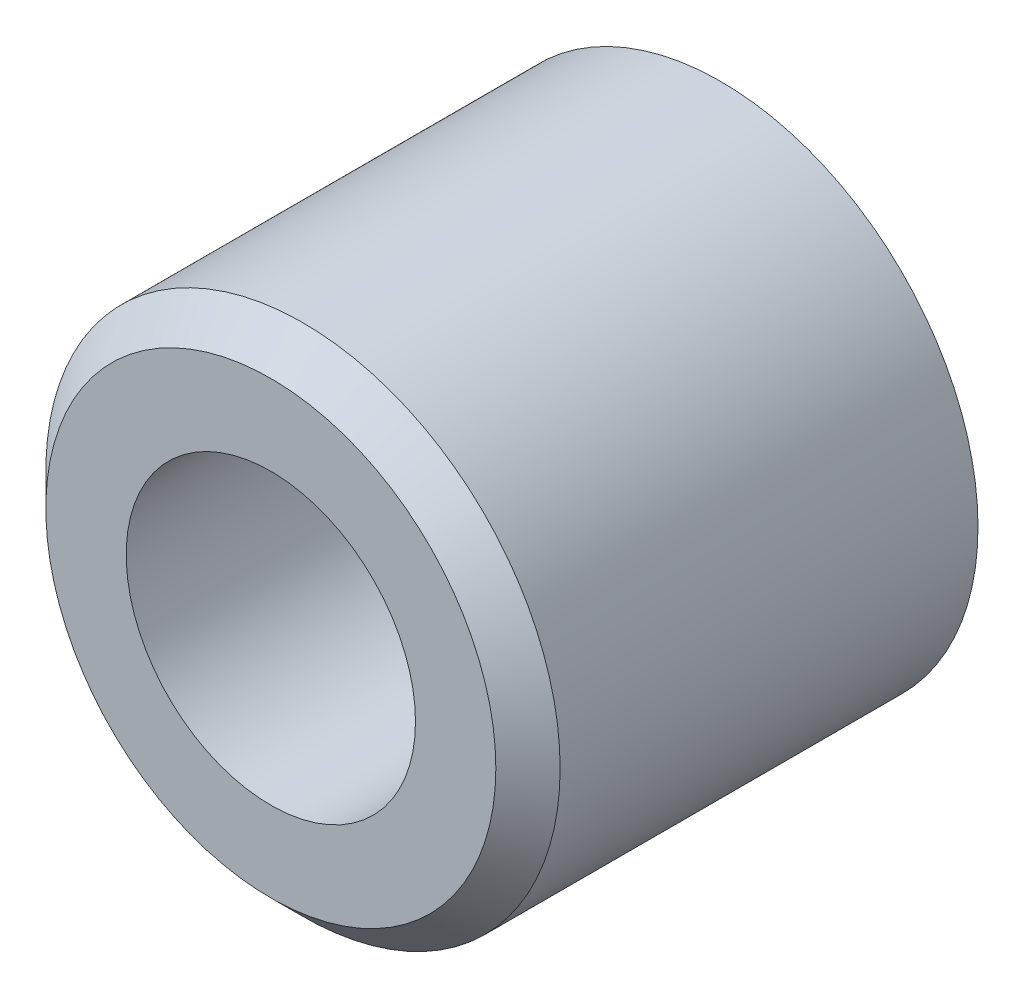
from build123d import *

# Parameters (mm, degrees)
ESQUISSE1_R        = 4
ESQUISSE1_R_2      = 2.25
BOSS_EXTRU_1_DEPTH = 7
CHANFREIN1_SIZE    = 0.5


with BuildPart() as part:
    # Esquisse1 → Boss.-Extru.1 (new body)
    with BuildSketch(Plane.XY):
        Circle(ESQUISSE1_R)
        Circle(ESQUISSE1_R_2, mode=Mode.SUBTRACT)
    extrude(amount=BOSS_EXTRU_1_DEPTH)

    # Chanfrein1
    chanfrein1_edges = [part.edges().sort_by_distance(p)[0] for p in [
        (-4, 0, 7),
    ]]
    chamfer(chanfrein1_edges, length=CHANFREIN1_SIZE)


solid = part.part
